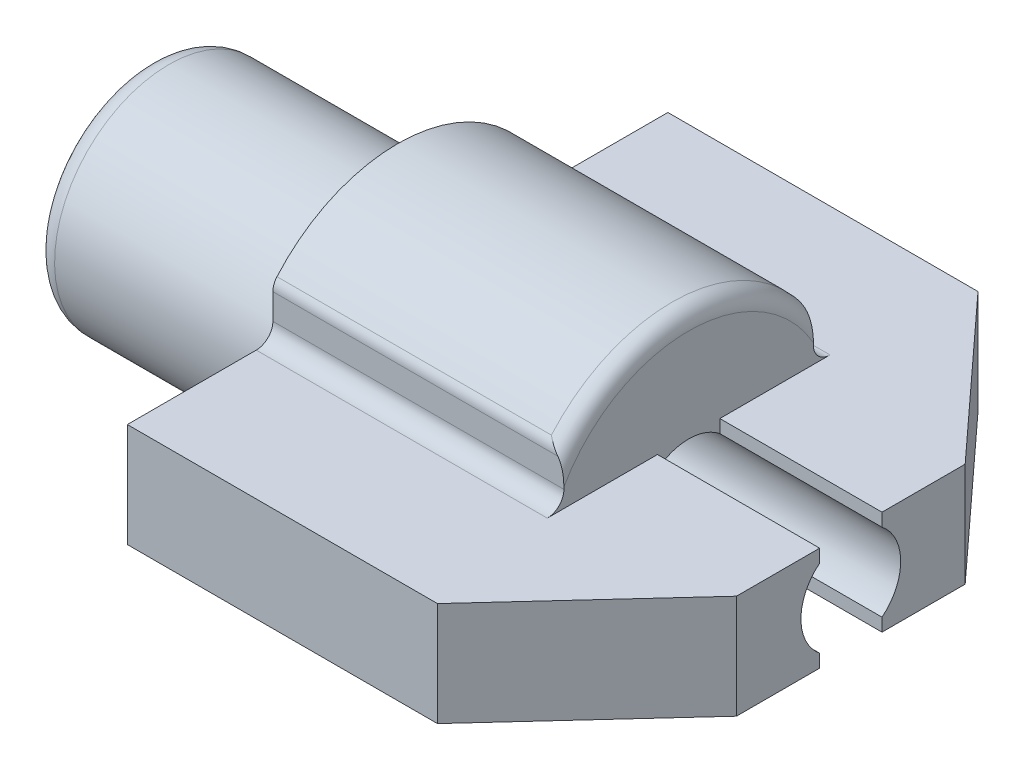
from build123d import *

# Parameters (mm, degrees)
ODEBRAT_VYSUNUT_M1_DEPTH      = 30.44893886
ODEBRAT_VYSUNUT_M3_DEPTH      = 29.98689359
ODEBRAT_VYSUNUT_M3_DEPTH_BACK = 29.98689359
SKICA3_W                      = 12.496399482
SKICA3_H                      = 12.887693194
SKICA4_W                      = 10
SKICA4_H                      = 6
ODEBRAT_VYSUNUT_M4_DEPTH      = 40.53137994
ZAOBLIT1_R                    = 0.8
SKICA5_W                      = 7.8
SKICA5_H                      = 1.5
ODEBRAT_VYSUNUT_M5_DEPTH      = 40.53137996
SKICA6_R                      = 2.4
ODEBRAT_VYSUNUT_M6_DEPTH      = 24
SKICA7_W                      = 15.6
SKICA7_H                      = 3
ODEBRAT_VYSUNUT_M7_DEPTH      = 37.792526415
P_IDAT_VYSUNUT_M1_DEPTH       = 5
ZAOBLIT2_R                    = 1
ZAOBLIT3_R                    = 0.2


with BuildPart() as part:
    # Skica1 → Rotovat1 (revolve)
    with BuildSketch(Plane.XY):
        Polygon((0, 0), (0, 5.5), (12, 5.5), (12, 14), (26, 14), (33.8, 5.5), (33.8, 0), align=None)
    revolve(axis=Axis((33.8, 0, 0), (-1, 0, 0)))

    # Skica2 → Odebrat vysunut_m1 (cut, through all)
    with BuildSketch(Plane.ZY.offset(-12)):
        Polygon((13, 2.5), (6, 2.5), (6, 15.027794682), (16.637345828, 15.027794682), (16.637345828, -15.027794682), (6, -15.027794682), (6, -2.5), (13, -2.5), align=None)
        Polygon((-13, 2.5), (-13, -2.5), (-6, -2.5), (-6, -15.027794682), (-16.637345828, -15.027794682), (-16.637345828, 15.027794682), (-6, 15.027794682), (-6, 2.5), align=None)
    extrude(amount=-ODEBRAT_VYSUNUT_M1_DEPTH, mode=Mode.SUBTRACT)

    # Skica3 → Odebrat vysunut_m3 (cut, two sides: drawn at the far end of the back side and taken through both)
    with BuildSketch(Plane.ZY.offset(-12).offset(-ODEBRAT_VYSUNUT_M3_DEPTH_BACK)):
        with Locations((0, -10.443846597)):
            Rectangle(SKICA3_W, SKICA3_H)
        with BuildLine():
            Line((-6.858005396, 3.501108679), (-14.194249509, 3.501108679))
            Line((-14.194249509, 3.501108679), (-14.194249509, 14.97180087))
            Line((-14.194249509, 14.97180087), (10.31822737, 14.97180087))
            Line((10.31822737, 14.97180087), (10.31822737, 3.501108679))
            Line((10.31822737, 3.501108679), (6.858005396, 3.501108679))
            ThreePointArc((6.858005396, 3.501108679), (0, 7.7), (-6.858005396, 3.501108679))
        make_face()
    extrude(amount=ODEBRAT_VYSUNUT_M3_DEPTH + ODEBRAT_VYSUNUT_M3_DEPTH_BACK, mode=Mode.SUBTRACT)

    # Skica4 → Odebrat vysunut_m4 (cut, through all)
    with BuildSketch(Plane(origin=(0, 0, -6), x_dir=(-1, 0, 0), z_dir=(0, 0, -1))):
        with Locations((-31, 5.5)):
            Rectangle(SKICA4_W, SKICA4_H)
    extrude(amount=-ODEBRAT_VYSUNUT_M4_DEPTH, mode=Mode.SUBTRACT)

    # Zaoblit1
    zaoblit1_edges = [part.edges().sort_by_distance(p)[0] for p in [
        (19, 4.825971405, -6),
        (19, 4.825971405, 6),
        (26, 7.7, 0),
        (19, 2.5, -6),
        (19, 2.5, 6),
    ]]
    fillet(zaoblit1_edges, radius=ZAOBLIT1_R)

    # Skica5 → Odebrat vysunut_m5 (cut, through all)
    with BuildSketch(Plane(origin=(0, 0, -6), x_dir=(-1, 0, 0), z_dir=(0, 0, -1))):
        with Locations((-29.9, -3.25)):
            Rectangle(SKICA5_W, SKICA5_H)
    extrude(amount=-ODEBRAT_VYSUNUT_M5_DEPTH, mode=Mode.SUBTRACT)

    # Skica6 → Odebrat vysunut_m6 (cut)
    with BuildSketch(Plane(origin=(33.8, 0, 0), x_dir=(0, 0, -1), z_dir=(1, 0, 0))):
        with Locations(Location((0, 0, 0), (0, 0, 90))):
            Circle(SKICA6_R)
    extrude(amount=-ODEBRAT_VYSUNUT_M6_DEPTH, mode=Mode.SUBTRACT)

    # Skica7 → Odebrat vysunut_m7 (cut, through all)
    with BuildSketch(Plane(origin=(0, 2.5, 0), x_dir=(1, 0, 0), z_dir=(0, 1, 0))):
        with Locations((33.8, 0)):
            Rectangle(SKICA7_W, SKICA7_H)
    extrude(amount=-ODEBRAT_VYSUNUT_M7_DEPTH, mode=Mode.SUBTRACT)

    # Skica8 → P_idat vysunut_m1 (add)
    with BuildSketch(Plane(origin=(0, 2.5, 0), x_dir=(1, 0, 0), z_dir=(0, 1, 0))):
        Polygon((26.699061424, 13), (26.917647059, 13), (33.8, 5.5), (33.8, 4.898979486), align=None)
        Polygon((33.8, -4.898979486), (33.8, -5.5), (26.917647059, -13), (26.699061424, -13), align=None)
    extrude(amount=-P_IDAT_VYSUNUT_M1_DEPTH)

    # Zaoblit2
    zaoblit2_edges = [part.edges().sort_by_distance(p)[0] for p in [
        (0, 5.5, 0),
    ]]
    fillet(zaoblit2_edges, radius=ZAOBLIT2_R)

    # Zaoblit3
    zaoblit3_edges = [part.edges().sort_by_distance(p)[0] for p in [
        (19, -2.5, -6),
        (19, -2.5, 6),
        (26, -2.5, 3.75),
        (26, -2.5, -3.75),
    ]]
    fillet(zaoblit3_edges, radius=ZAOBLIT3_R)


solid = part.part
